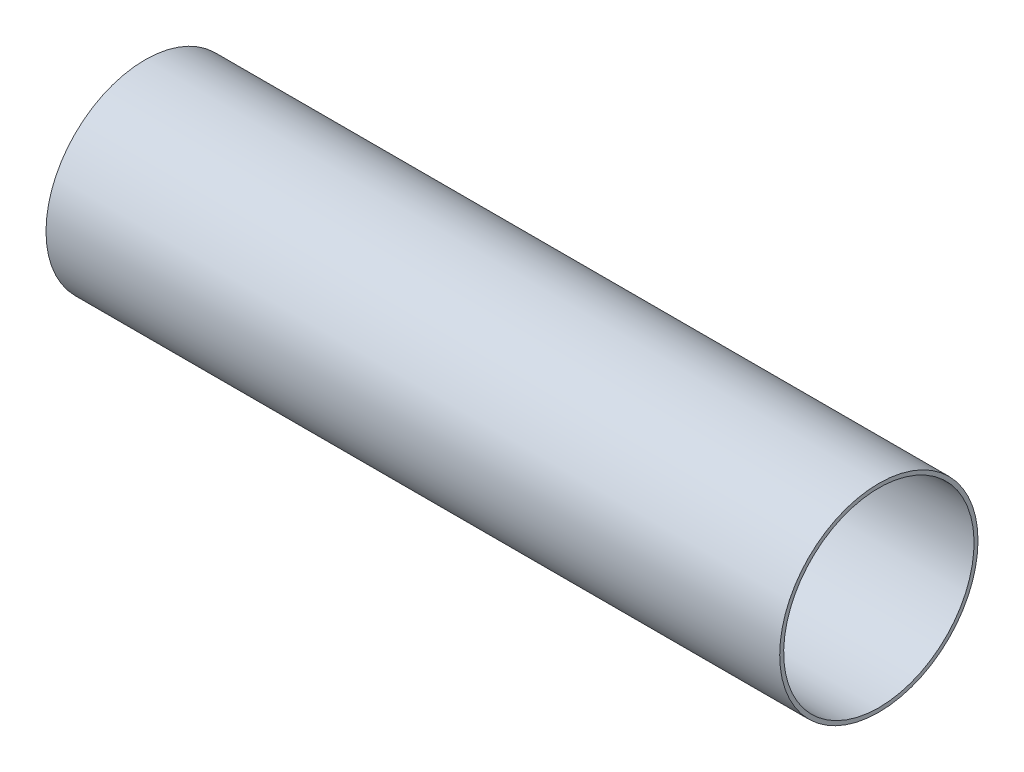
from build123d import *

# Parameters (mm, degrees)
ESQUISSE1_W = 185
ESQUISSE1_H = 1


with BuildPart() as part:
    # Esquisse1 → Base-R_volution (revolve)
    with BuildSketch(Plane.XY, mode=Mode.PRIVATE) as base_r_volution_sk:
        with Locations((0, 24.5)):
            Rectangle(ESQUISSE1_W, ESQUISSE1_H)
    revolve(base_r_volution_sk.sketch.rotate(Axis((-141.928011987, 0, 0), (1, 0, 0)), 180), axis=Axis((-141.928011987, 0, 0), (1, 0, 0)))


solid = part.part
